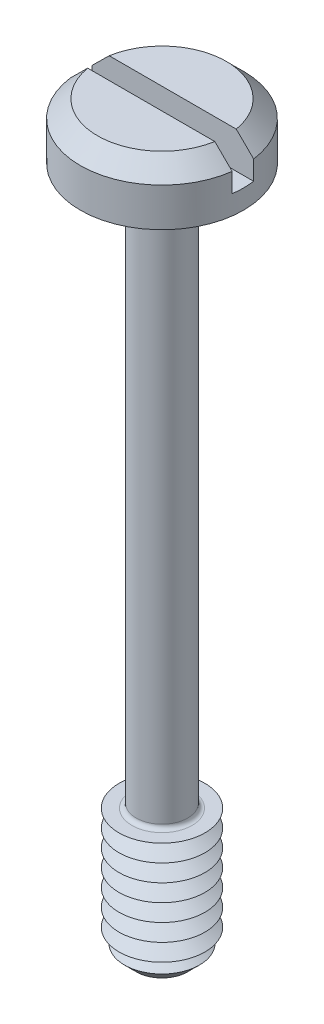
ISO-10303-21;
HEADER;
FILE_DESCRIPTION(('STEP AP214'),'2;1');
FILE_NAME('part.step','',(''),(''),'','','');
FILE_SCHEMA(('AUTOMOTIVE_DESIGN { 1 0 10303 214 1 1 1 1 }'));
ENDSEC;
DATA;
#1=APPLICATION_CONTEXT('core data for automotive mechanical design processes');
#2=APPLICATION_PROTOCOL_DEFINITION('international standard','automotive_design',2000,#1);
#3=PRODUCT_CONTEXT('',#1,'mechanical');
#4=PRODUCT('Part','Part','',(#3));
#5=PRODUCT_RELATED_PRODUCT_CATEGORY('part','',(#4));
#6=PRODUCT_DEFINITION_FORMATION('','',#4);
#7=PRODUCT_DEFINITION_CONTEXT('part definition',#1,'design');
#8=PRODUCT_DEFINITION('design','',#6,#7);
#9=PRODUCT_DEFINITION_SHAPE('','',#8);
#10=(LENGTH_UNIT() NAMED_UNIT(*) SI_UNIT(.MILLI.,.METRE.));
#11=(NAMED_UNIT(*) PLANE_ANGLE_UNIT() SI_UNIT($,.RADIAN.));
#12=(NAMED_UNIT(*) SI_UNIT($,.STERADIAN.) SOLID_ANGLE_UNIT());
#13=UNCERTAINTY_MEASURE_WITH_UNIT(LENGTH_MEASURE(1.E-05),#10,'distance_accuracy_value','');
#14=(GEOMETRIC_REPRESENTATION_CONTEXT(3) GLOBAL_UNCERTAINTY_ASSIGNED_CONTEXT((#13)) GLOBAL_UNIT_ASSIGNED_CONTEXT((#10,
#11,#12)) REPRESENTATION_CONTEXT('',''));
#15=CARTESIAN_POINT('',(0.,0.,0.));
#16=DIRECTION('',(0.,0.,1.));
#17=DIRECTION('',(1.,0.,0.));
#18=AXIS2_PLACEMENT_3D('',#15,#16,#17);
#19=CARTESIAN_POINT('',(0.,1.3,0.));
#20=DIRECTION('',(0.,1.,0.));
#21=DIRECTION('',(0.,0.,1.));
#22=AXIS2_PLACEMENT_3D('',#19,#20,#21);
#23=PLANE('',#22);
#24=DIRECTION('',(-1.,0.,0.));
#25=VECTOR('',#24,1.);
#26=CARTESIAN_POINT('',(1.9,1.3,-0.25));
#27=LINE('',#26,#25);
#28=CARTESIAN_POINT('',(1.4790199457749,1.3,-0.25));
#29=VERTEX_POINT('',#28);
#30=CARTESIAN_POINT('',(-1.4790199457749,1.3,-0.25));
#31=VERTEX_POINT('',#30);
#32=EDGE_CURVE('E110',#29,#31,#27,.T.);
#33=ORIENTED_EDGE('',*,*,#32,.F.);
#34=CARTESIAN_POINT('',(0.,1.3,0.));
#35=DIRECTION('',(0.,1.,0.));
#36=DIRECTION('',(0.,0.,1.));
#37=AXIS2_PLACEMENT_3D('',#34,#35,#36);
#38=CIRCLE('',#37,1.5);
#39=EDGE_CURVE('E113',#29,#31,#38,.T.);
#40=ORIENTED_EDGE('',*,*,#39,.T.);
#41=EDGE_LOOP('',(#33,#40));
#42=FACE_BOUND('',#41,.T.);
#43=ADVANCED_FACE('F39',(#42),#23,.T.);
#44=CARTESIAN_POINT('',(0.,1.3,0.));
#45=DIRECTION('',(0.,-1.,0.));
#46=DIRECTION('',(0.,0.,-1.));
#47=AXIS2_PLACEMENT_3D('',#44,#45,#46);
#48=CONICAL_SURFACE('',#47,1.5,0.785398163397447);
#49=CARTESIAN_POINT('',(4.18533688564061,-1.39279678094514,-0.25));
#50=CARTESIAN_POINT('',(4.04229038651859,-1.25000682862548,-0.25));
#51=CARTESIAN_POINT('',(3.89923277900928,-1.10722799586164,-0.25));
#52=CARTESIAN_POINT('',(3.61307916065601,-0.821704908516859,-0.25));
#53=CARTESIAN_POINT('',(3.46998314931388,-0.67896065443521,-0.25));
#54=CARTESIAN_POINT('',(3.1836962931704,-0.39347893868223,-0.25));
#55=CARTESIAN_POINT('',(3.0405054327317,-0.250741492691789,-0.25));
#56=CARTESIAN_POINT('',(2.75404923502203,0.0346548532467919,-0.25));
#57=CARTESIAN_POINT('',(2.61078389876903,0.177313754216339,-0.25));
#58=CARTESIAN_POINT('',(2.32055190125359,0.466067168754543,-0.25));
#59=CARTESIAN_POINT('',(2.17358212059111,0.612158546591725,-0.25));
#60=CARTESIAN_POINT('',(1.87941274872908,0.904121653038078,-0.25));
#61=CARTESIAN_POINT('',(1.73221314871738,1.04999337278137,-0.25));
#62=CARTESIAN_POINT('',(1.51107316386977,1.26842721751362,-0.25));
#63=CARTESIAN_POINT('',(1.43731034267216,1.34116907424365,-0.25));
#64=CARTESIAN_POINT('',(1.28959621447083,1.48646381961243,-0.25));
#65=CARTESIAN_POINT('',(1.21564490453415,1.55901670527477,-0.25));
#66=CARTESIAN_POINT('',(1.06743357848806,1.7037953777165,-0.25));
#67=CARTESIAN_POINT('',(0.993173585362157,1.77602118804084,-0.25));
#68=CARTESIAN_POINT('',(0.844093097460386,1.91989140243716,-0.25));
#69=CARTESIAN_POINT('',(0.769272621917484,1.99153582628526,-0.25));
#70=CARTESIAN_POINT('',(0.673453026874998,2.0816726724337,-0.25));
#71=CARTESIAN_POINT('',(0.653038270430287,2.10078477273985,-0.25));
#72=CARTESIAN_POINT('',(0.612082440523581,2.13887320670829,-0.25));
#73=CARTESIAN_POINT('',(0.591541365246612,2.15784953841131,-0.25));
#74=CARTESIAN_POINT('',(0.529771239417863,2.21444296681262,-0.25));
#75=CARTESIAN_POINT('',(0.488307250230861,2.25180787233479,-0.25));
#76=CARTESIAN_POINT('',(0.419663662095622,2.31168392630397,-0.25));
#77=CARTESIAN_POINT('',(0.392840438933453,2.33460285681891,-0.25));
#78=CARTESIAN_POINT('',(0.33832923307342,2.37961554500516,-0.25));
#79=CARTESIAN_POINT('',(0.310638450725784,2.40170598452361,-0.25));
#80=CARTESIAN_POINT('',(0.26798327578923,2.43362951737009,-0.25));
#81=CARTESIAN_POINT('',(0.253509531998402,2.44411383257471,-0.25));
#82=CARTESIAN_POINT('',(0.224109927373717,2.46442369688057,-0.25));
#83=CARTESIAN_POINT('',(0.209184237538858,2.47424949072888,-0.25));
#84=CARTESIAN_POINT('',(0.178776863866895,2.49288890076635,-0.25));
#85=CARTESIAN_POINT('',(0.163297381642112,2.50170604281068,-0.25));
#86=CARTESIAN_POINT('',(0.131578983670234,2.51781823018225,-0.25));
#87=CARTESIAN_POINT('',(0.11534152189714,2.52511605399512,-0.25));
#88=CARTESIAN_POINT('',(0.0816993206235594,2.53745946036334,-0.25));
#89=CARTESIAN_POINT('',(0.0642805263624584,2.54246888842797,-0.25));
#90=CARTESIAN_POINT('',(0.028863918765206,2.54892929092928,-0.25));
#91=CARTESIAN_POINT('',(0.0108708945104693,2.55040442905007,-0.25));
#92=CARTESIAN_POINT('',(-0.0250443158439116,2.54939473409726,-0.25));
#93=CARTESIAN_POINT('',(-0.0429661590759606,2.54689872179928,-0.25));
#94=CARTESIAN_POINT('',(-0.0781147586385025,2.53864961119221,-0.25));
#95=CARTESIAN_POINT('',(-0.0953356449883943,2.53287340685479,-0.25));
#96=CARTESIAN_POINT('',(-0.132199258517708,2.51779776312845,-0.25));
#97=CARTESIAN_POINT('',(-0.151639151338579,2.50802516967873,-0.25));
#98=CARTESIAN_POINT('',(-0.189519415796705,2.48667393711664,-0.25));
#99=CARTESIAN_POINT('',(-0.20795716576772,2.47509084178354,-0.25));
#100=CARTESIAN_POINT('',(-0.244227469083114,2.45076455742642,-0.25));
#101=CARTESIAN_POINT('',(-0.262054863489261,2.4380137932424,-0.25));
#102=CARTESIAN_POINT('',(-0.297164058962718,2.41183569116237,-0.25));
#103=CARTESIAN_POINT('',(-0.314446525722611,2.39840923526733,-0.25));
#104=CARTESIAN_POINT('',(-0.37105344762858,2.35323015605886,-0.25));
#105=CARTESIAN_POINT('',(-0.409598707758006,2.32050831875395,-0.25));
#106=CARTESIAN_POINT('',(-0.485753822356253,2.25398879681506,-0.25));
#107=CARTESIAN_POINT('',(-0.5233632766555,2.22019066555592,-0.25));
#108=CARTESIAN_POINT('',(-0.598084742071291,2.15194710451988,-0.25));
#109=CARTESIAN_POINT('',(-0.635196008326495,2.1175008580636,-0.25));
#110=CARTESIAN_POINT('',(-0.709072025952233,2.04825489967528,-0.25));
#111=CARTESIAN_POINT('',(-0.745836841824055,2.0134552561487,-0.25));
#112=CARTESIAN_POINT('',(-0.855349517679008,1.90914588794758,-0.25));
#113=CARTESIAN_POINT('',(-0.927775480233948,1.83929849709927,-0.25));
#114=CARTESIAN_POINT('',(-1.07215273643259,1.69921833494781,-0.25));
#115=CARTESIAN_POINT('',(-1.14410432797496,1.62898586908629,-0.25));
#116=CARTESIAN_POINT('',(-1.33992197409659,1.43719038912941,-0.25));
#117=CARTESIAN_POINT('',(-1.46354933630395,1.3153837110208,-0.25));
#118=CARTESIAN_POINT('',(-1.71048263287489,1.07144356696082,-0.25));
#119=CARTESIAN_POINT('',(-1.83378856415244,0.949310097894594,-0.25));
#120=CARTESIAN_POINT('',(-2.20352581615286,0.582566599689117,-0.25));
#121=CARTESIAN_POINT('',(-2.44969583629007,0.337693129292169,-0.25));
#122=CARTESIAN_POINT('',(-2.94423335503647,-0.154747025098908,-0.25));
#123=CARTESIAN_POINT('',(-3.19259832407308,-0.402316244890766,-0.25));
#124=CARTESIAN_POINT('',(-3.68909403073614,-0.897516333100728,-0.25));
#125=CARTESIAN_POINT('',(-3.93722481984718,-1.14514714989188,-0.25));
#126=CARTESIAN_POINT('',(-4.18533688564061,-1.39279678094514,-0.25));
#127=B_SPLINE_CURVE_WITH_KNOTS('',3,(#49,#50,#51,#52,#53,#54,#55,#56,#57,#58,#59,#60,#61,#62,
#63,#64,#65,#66,#67,#68,#69,#70,#71,#72,#73,#74,#75,#76,#77,#78,#79,#80,#81,#82,#83,#84,#85,#86,
#87,#88,#89,#90,#91,#92,#93,#94,#95,#96,#97,#98,#99,#100,#101,#102,#103,#104,#105,#106,#107,
#108,#109,#110,#111,#112,#113,#114,#115,#116,#117,#118,#119,#120,#121,#122,#123,#124,#125,#126),
.UNSPECIFIED.,.F.,.F.,(4,2,2,2,2,2,2,2,2,2,2,2,2,2,2,2,2,2,2,2,2,2,2,2,2,2,2,2,2,2,2,2,2,2,2,2,
2,2,4),(0.,0.606350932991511,1.2127101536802,1.81925643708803,2.42579463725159,3.04747398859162,
3.66917779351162,3.97996857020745,4.29076421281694,4.60153711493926,4.91229940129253,
4.99619332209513,5.08008845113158,5.24751495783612,5.35335108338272,5.45957361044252,
5.51317784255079,5.56676204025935,5.62015280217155,5.67344504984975,5.72755238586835,
5.78128872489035,5.83517660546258,5.88944887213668,5.95455572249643,6.01982542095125,
6.08555345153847,6.15119780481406,6.30282427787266,6.45451451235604,6.60641073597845,
6.75827809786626,7.06012987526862,7.36176945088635,7.88242595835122,8.40308744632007,
9.44475070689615,10.4967873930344,11.5484571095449),.UNSPECIFIED.);
#128=CARTESIAN_POINT('',(1.88348082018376,0.899999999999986,-0.25));
#129=VERTEX_POINT('',#128);
#130=EDGE_CURVE('E252',#129,#29,#127,.T.);
#131=ORIENTED_EDGE('',*,*,#130,.F.);
#132=CARTESIAN_POINT('',(0.,0.9,0.));
#133=DIRECTION('',(0.,1.,0.));
#134=DIRECTION('',(0.,0.,1.));
#135=AXIS2_PLACEMENT_3D('',#132,#133,#134);
#136=CIRCLE('',#135,1.9);
#137=CARTESIAN_POINT('',(-1.88348082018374,0.9,-0.25));
#138=VERTEX_POINT('',#137);
#139=EDGE_CURVE('E128',#138,#129,#136,.F.);
#140=ORIENTED_EDGE('',*,*,#139,.F.);
#141=EDGE_CURVE('E102',#31,#138,#127,.T.);
#142=ORIENTED_EDGE('',*,*,#141,.F.);
#143=ORIENTED_EDGE('',*,*,#39,.F.);
#144=EDGE_LOOP('',(#131,#140,#142,#143));
#145=FACE_BOUND('',#144,.T.);
#146=ADVANCED_FACE('F214',(#145),#48,.T.);
#147=CARTESIAN_POINT('',(0.,-16.,0.));
#148=DIRECTION('',(0.,1.,0.));
#149=DIRECTION('',(0.,0.,1.));
#150=AXIS2_PLACEMENT_3D('',#147,#148,#149);
#151=CYLINDRICAL_SURFACE('',#150,0.6);
#152=CARTESIAN_POINT('',(0.,-12.9,0.));
#153=DIRECTION('',(0.,-1.,0.));
#154=DIRECTION('',(0.,0.,-1.));
#155=AXIS2_PLACEMENT_3D('',#152,#153,#154);
#156=CIRCLE('',#155,0.6);
#157=CARTESIAN_POINT('',(0.,-12.9,-0.6));
#158=VERTEX_POINT('',#157);
#159=EDGE_CURVE('E123',#158,#158,#156,.F.);
#160=ORIENTED_EDGE('',*,*,#159,.T.);
#161=EDGE_LOOP('',(#160));
#162=FACE_BOUND('',#161,.T.);
#163=CARTESIAN_POINT('',(0.,-0.0999999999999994,0.));
#164=DIRECTION('',(0.,1.,0.));
#165=DIRECTION('',(0.,0.,1.));
#166=AXIS2_PLACEMENT_3D('',#163,#164,#165);
#167=CIRCLE('',#166,0.6);
#168=CARTESIAN_POINT('',(0.,-0.0999999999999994,0.6));
#169=VERTEX_POINT('',#168);
#170=EDGE_CURVE('E351',#169,#169,#167,.F.);
#171=ORIENTED_EDGE('',*,*,#170,.T.);
#172=EDGE_LOOP('',(#171));
#173=FACE_BOUND('',#172,.T.);
#174=ADVANCED_FACE('F210',(#162,#173),#151,.T.);
#175=CARTESIAN_POINT('',(0.,1.3,0.));
#176=DIRECTION('',(0.,-1.,0.));
#177=DIRECTION('',(0.,0.,-1.));
#178=AXIS2_PLACEMENT_3D('',#175,#176,#177);
#179=CYLINDRICAL_SURFACE('',#178,1.9);
#180=ORIENTED_EDGE('',*,*,#139,.T.);
#181=DIRECTION('',(0.,-1.,0.));
#182=VECTOR('',#181,1.);
#183=CARTESIAN_POINT('',(1.88348082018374,1.3,-0.25));
#184=LINE('',#183,#182);
#185=CARTESIAN_POINT('',(1.88348082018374,0.45,-0.25));
#186=VERTEX_POINT('',#185);
#187=EDGE_CURVE('E64',#129,#186,#184,.T.);
#188=ORIENTED_EDGE('',*,*,#187,.T.);
#189=CARTESIAN_POINT('',(0.,0.45,0.));
#190=DIRECTION('',(0.,1.,0.));
#191=DIRECTION('',(0.,0.,1.));
#192=AXIS2_PLACEMENT_3D('',#189,#190,#191);
#193=CIRCLE('',#192,1.9);
#194=CARTESIAN_POINT('',(1.88348082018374,0.45,0.25));
#195=VERTEX_POINT('',#194);
#196=EDGE_CURVE('E11',#195,#186,#193,.T.);
#197=ORIENTED_EDGE('',*,*,#196,.F.);
#198=DIRECTION('',(0.,-1.,0.));
#199=VECTOR('',#198,1.);
#200=CARTESIAN_POINT('',(1.88348082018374,1.3,0.25));
#201=LINE('',#200,#199);
#202=CARTESIAN_POINT('',(1.88348082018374,0.9,0.25));
#203=VERTEX_POINT('',#202);
#204=EDGE_CURVE('E271',#195,#203,#201,.F.);
#205=ORIENTED_EDGE('',*,*,#204,.T.);
#206=CARTESIAN_POINT('',(-1.88348082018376,0.899999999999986,0.25));
#207=VERTEX_POINT('',#206);
#208=EDGE_CURVE('E120',#203,#207,#136,.F.);
#209=ORIENTED_EDGE('',*,*,#208,.T.);
#210=DIRECTION('',(0.,-1.,0.));
#211=VECTOR('',#210,1.);
#212=CARTESIAN_POINT('',(-1.88348082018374,1.3,0.25));
#213=LINE('',#212,#211);
#214=CARTESIAN_POINT('',(-1.88348082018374,0.45,0.25));
#215=VERTEX_POINT('',#214);
#216=EDGE_CURVE('E96',#207,#215,#213,.T.);
#217=ORIENTED_EDGE('',*,*,#216,.T.);
#218=CARTESIAN_POINT('',(-1.88348082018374,0.45,-0.25));
#219=VERTEX_POINT('',#218);
#220=EDGE_CURVE('E44',#219,#215,#193,.T.);
#221=ORIENTED_EDGE('',*,*,#220,.F.);
#222=DIRECTION('',(0.,-1.,0.));
#223=VECTOR('',#222,1.);
#224=CARTESIAN_POINT('',(-1.88348082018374,1.3,-0.25));
#225=LINE('',#224,#223);
#226=EDGE_CURVE('E275',#219,#138,#225,.F.);
#227=ORIENTED_EDGE('',*,*,#226,.T.);
#228=EDGE_LOOP('',(#180,#188,#197,#205,#209,#217,#221,#227));
#229=FACE_BOUND('',#228,.T.);
#230=CARTESIAN_POINT('',(0.,0.,0.));
#231=DIRECTION('',(0.,1.,0.));
#232=DIRECTION('',(0.,0.,1.));
#233=AXIS2_PLACEMENT_3D('',#230,#231,#232);
#234=CIRCLE('',#233,1.9);
#235=CARTESIAN_POINT('',(0.,0.,1.9));
#236=VERTEX_POINT('',#235);
#237=EDGE_CURVE('E336',#236,#236,#234,.T.);
#238=ORIENTED_EDGE('',*,*,#237,.T.);
#239=EDGE_LOOP('',(#238));
#240=FACE_BOUND('',#239,.T.);
#241=ADVANCED_FACE('F213',(#229,#240),#179,.T.);
#242=DIRECTION('',(1.,0.,0.));
#243=VECTOR('',#242,1.);
#244=CARTESIAN_POINT('',(1.9,1.3,0.25));
#245=LINE('',#244,#243);
#246=CARTESIAN_POINT('',(-1.4790199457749,1.3,0.25));
#247=VERTEX_POINT('',#246);
#248=CARTESIAN_POINT('',(1.47901994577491,1.3,0.25));
#249=VERTEX_POINT('',#248);
#250=EDGE_CURVE('E56',#247,#249,#245,.T.);
#251=ORIENTED_EDGE('',*,*,#250,.F.);
#252=EDGE_CURVE('E108',#247,#249,#38,.T.);
#253=ORIENTED_EDGE('',*,*,#252,.T.);
#254=EDGE_LOOP('',(#251,#253));
#255=FACE_BOUND('',#254,.T.);
#256=ADVANCED_FACE('F107',(#255),#23,.T.);
#257=CARTESIAN_POINT('',(0.,0.,0.));
#258=DIRECTION('',(0.,1.,0.));
#259=DIRECTION('',(0.,0.,1.));
#260=AXIS2_PLACEMENT_3D('',#257,#258,#259);
#261=PLANE('',#260);
#262=CARTESIAN_POINT('',(0.,0.,0.));
#263=DIRECTION('',(0.,1.,0.));
#264=DIRECTION('',(0.,0.,1.));
#265=AXIS2_PLACEMENT_3D('',#262,#263,#264);
#266=CIRCLE('',#265,0.7);
#267=CARTESIAN_POINT('',(0.,0.,0.7));
#268=VERTEX_POINT('',#267);
#269=EDGE_CURVE('E114',#268,#268,#266,.T.);
#270=ORIENTED_EDGE('',*,*,#269,.T.);
#271=EDGE_LOOP('',(#270));
#272=FACE_BOUND('',#271,.T.);
#273=ORIENTED_EDGE('',*,*,#237,.F.);
#274=EDGE_LOOP('',(#273));
#275=FACE_BOUND('',#274,.T.);
#276=ADVANCED_FACE('F204',(#272,#275),#261,.F.);
#277=CARTESIAN_POINT('',(0.,-13.,0.));
#278=DIRECTION('',(0.,-1.,0.));
#279=DIRECTION('',(0.,0.,-1.));
#280=AXIS2_PLACEMENT_3D('',#277,#278,#279);
#281=PLANE('',#280);
#282=CARTESIAN_POINT('',(0.,-13.,0.));
#283=DIRECTION('',(0.,-1.,0.));
#284=DIRECTION('',(0.,0.,-1.));
#285=AXIS2_PLACEMENT_3D('',#282,#283,#284);
#286=CIRCLE('',#285,0.7);
#287=CARTESIAN_POINT('',(0.,-13.,-0.7));
#288=VERTEX_POINT('',#287);
#289=EDGE_CURVE('E344',#288,#288,#286,.T.);
#290=ORIENTED_EDGE('',*,*,#289,.T.);
#291=EDGE_LOOP('',(#290));
#292=FACE_BOUND('',#291,.T.);
#293=CARTESIAN_POINT('',(0.,-13.,0.));
#294=DIRECTION('',(0.,1.,0.));
#295=DIRECTION('',(0.,0.,1.));
#296=AXIS2_PLACEMENT_3D('',#293,#294,#295);
#297=CIRCLE('',#296,1.);
#298=CARTESIAN_POINT('',(0.,-13.,1.));
#299=VERTEX_POINT('',#298);
#300=EDGE_CURVE('E333',#299,#299,#297,.T.);
#301=ORIENTED_EDGE('',*,*,#300,.T.);
#302=EDGE_LOOP('',(#301));
#303=FACE_BOUND('',#302,.T.);
#304=ADVANCED_FACE('F200',(#292,#303),#281,.F.);
#305=CARTESIAN_POINT('',(0.,-13.2,0.));
#306=DIRECTION('',(0.,1.,0.));
#307=DIRECTION('',(0.,0.,1.));
#308=AXIS2_PLACEMENT_3D('',#305,#306,#307);
#309=CONICAL_SURFACE('',#308,0.653589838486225,1.0471975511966);
#310=ORIENTED_EDGE('',*,*,#300,.F.);
#311=EDGE_LOOP('',(#310));
#312=FACE_BOUND('',#311,.T.);
#313=CARTESIAN_POINT('',(0.,-13.2,0.));
#314=DIRECTION('',(0.,1.,0.));
#315=DIRECTION('',(0.,0.,1.));
#316=AXIS2_PLACEMENT_3D('',#313,#314,#315);
#317=CIRCLE('',#316,0.653589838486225);
#318=CARTESIAN_POINT('',(0.,-13.2,0.653589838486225));
#319=VERTEX_POINT('',#318);
#320=EDGE_CURVE('E329',#319,#319,#317,.T.);
#321=ORIENTED_EDGE('',*,*,#320,.T.);
#322=EDGE_LOOP('',(#321));
#323=FACE_BOUND('',#322,.T.);
#324=ADVANCED_FACE('F196',(#312,#323),#309,.T.);
#325=CARTESIAN_POINT('',(0.,-13.4,0.));
#326=DIRECTION('',(0.,-1.,0.));
#327=DIRECTION('',(0.,0.,-1.));
#328=AXIS2_PLACEMENT_3D('',#325,#326,#327);
#329=CONICAL_SURFACE('',#328,1.,1.0471975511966);
#330=ORIENTED_EDGE('',*,*,#320,.F.);
#331=EDGE_LOOP('',(#330));
#332=FACE_BOUND('',#331,.T.);
#333=CARTESIAN_POINT('',(0.,-13.4,0.));
#334=DIRECTION('',(0.,1.,0.));
#335=DIRECTION('',(0.,0.,1.));
#336=AXIS2_PLACEMENT_3D('',#333,#334,#335);
#337=CIRCLE('',#336,1.);
#338=CARTESIAN_POINT('',(0.,-13.4,1.));
#339=VERTEX_POINT('',#338);
#340=EDGE_CURVE('E326',#339,#339,#337,.T.);
#341=ORIENTED_EDGE('',*,*,#340,.T.);
#342=EDGE_LOOP('',(#341));
#343=FACE_BOUND('',#342,.T.);
#344=ADVANCED_FACE('F192',(#332,#343),#329,.T.);
#345=CARTESIAN_POINT('',(0.,-13.6,0.));
#346=DIRECTION('',(0.,1.,0.));
#347=DIRECTION('',(0.,0.,1.));
#348=AXIS2_PLACEMENT_3D('',#345,#346,#347);
#349=CONICAL_SURFACE('',#348,0.653589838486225,1.0471975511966);
#350=ORIENTED_EDGE('',*,*,#340,.F.);
#351=EDGE_LOOP('',(#350));
#352=FACE_BOUND('',#351,.T.);
#353=CARTESIAN_POINT('',(0.,-13.6,0.));
#354=DIRECTION('',(0.,1.,0.));
#355=DIRECTION('',(0.,0.,1.));
#356=AXIS2_PLACEMENT_3D('',#353,#354,#355);
#357=CIRCLE('',#356,0.653589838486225);
#358=CARTESIAN_POINT('',(0.,-13.6,0.653589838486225));
#359=VERTEX_POINT('',#358);
#360=EDGE_CURVE('E323',#359,#359,#357,.T.);
#361=ORIENTED_EDGE('',*,*,#360,.T.);
#362=EDGE_LOOP('',(#361));
#363=FACE_BOUND('',#362,.T.);
#364=ADVANCED_FACE('F188',(#352,#363),#349,.T.);
#365=CARTESIAN_POINT('',(0.,-13.8,0.));
#366=DIRECTION('',(0.,-1.,0.));
#367=DIRECTION('',(0.,0.,-1.));
#368=AXIS2_PLACEMENT_3D('',#365,#366,#367);
#369=CONICAL_SURFACE('',#368,1.,1.0471975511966);
#370=ORIENTED_EDGE('',*,*,#360,.F.);
#371=EDGE_LOOP('',(#370));
#372=FACE_BOUND('',#371,.T.);
#373=CARTESIAN_POINT('',(0.,-13.8,0.));
#374=DIRECTION('',(0.,1.,0.));
#375=DIRECTION('',(0.,0.,1.));
#376=AXIS2_PLACEMENT_3D('',#373,#374,#375);
#377=CIRCLE('',#376,1.);
#378=CARTESIAN_POINT('',(0.,-13.8,1.));
#379=VERTEX_POINT('',#378);
#380=EDGE_CURVE('E319',#379,#379,#377,.T.);
#381=ORIENTED_EDGE('',*,*,#380,.T.);
#382=EDGE_LOOP('',(#381));
#383=FACE_BOUND('',#382,.T.);
#384=ADVANCED_FACE('F184',(#372,#383),#369,.T.);
#385=CARTESIAN_POINT('',(0.,-14.,0.));
#386=DIRECTION('',(0.,1.,0.));
#387=DIRECTION('',(0.,0.,1.));
#388=AXIS2_PLACEMENT_3D('',#385,#386,#387);
#389=CONICAL_SURFACE('',#388,0.653589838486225,1.0471975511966);
#390=ORIENTED_EDGE('',*,*,#380,.F.);
#391=EDGE_LOOP('',(#390));
#392=FACE_BOUND('',#391,.T.);
#393=CARTESIAN_POINT('',(0.,-14.,0.));
#394=DIRECTION('',(0.,1.,0.));
#395=DIRECTION('',(0.,0.,1.));
#396=AXIS2_PLACEMENT_3D('',#393,#394,#395);
#397=CIRCLE('',#396,0.653589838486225);
#398=CARTESIAN_POINT('',(0.,-14.,0.653589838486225));
#399=VERTEX_POINT('',#398);
#400=EDGE_CURVE('E315',#399,#399,#397,.T.);
#401=ORIENTED_EDGE('',*,*,#400,.T.);
#402=EDGE_LOOP('',(#401));
#403=FACE_BOUND('',#402,.T.);
#404=ADVANCED_FACE('F180',(#392,#403),#389,.T.);
#405=CARTESIAN_POINT('',(0.,-14.2,0.));
#406=DIRECTION('',(0.,-1.,0.));
#407=DIRECTION('',(0.,0.,-1.));
#408=AXIS2_PLACEMENT_3D('',#405,#406,#407);
#409=CONICAL_SURFACE('',#408,1.,1.0471975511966);
#410=ORIENTED_EDGE('',*,*,#400,.F.);
#411=EDGE_LOOP('',(#410));
#412=FACE_BOUND('',#411,.T.);
#413=CARTESIAN_POINT('',(0.,-14.2,0.));
#414=DIRECTION('',(0.,1.,0.));
#415=DIRECTION('',(0.,0.,1.));
#416=AXIS2_PLACEMENT_3D('',#413,#414,#415);
#417=CIRCLE('',#416,1.);
#418=CARTESIAN_POINT('',(0.,-14.2,1.));
#419=VERTEX_POINT('',#418);
#420=EDGE_CURVE('E311',#419,#419,#417,.T.);
#421=ORIENTED_EDGE('',*,*,#420,.T.);
#422=EDGE_LOOP('',(#421));
#423=FACE_BOUND('',#422,.T.);
#424=ADVANCED_FACE('F176',(#412,#423),#409,.T.);
#425=CARTESIAN_POINT('',(0.,-14.4,0.));
#426=DIRECTION('',(0.,1.,0.));
#427=DIRECTION('',(0.,0.,1.));
#428=AXIS2_PLACEMENT_3D('',#425,#426,#427);
#429=CONICAL_SURFACE('',#428,0.653589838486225,1.0471975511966);
#430=ORIENTED_EDGE('',*,*,#420,.F.);
#431=EDGE_LOOP('',(#430));
#432=FACE_BOUND('',#431,.T.);
#433=CARTESIAN_POINT('',(0.,-14.4,0.));
#434=DIRECTION('',(0.,1.,0.));
#435=DIRECTION('',(0.,0.,1.));
#436=AXIS2_PLACEMENT_3D('',#433,#434,#435);
#437=CIRCLE('',#436,0.653589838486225);
#438=CARTESIAN_POINT('',(0.,-14.4,0.653589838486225));
#439=VERTEX_POINT('',#438);
#440=EDGE_CURVE('E307',#439,#439,#437,.T.);
#441=ORIENTED_EDGE('',*,*,#440,.T.);
#442=EDGE_LOOP('',(#441));
#443=FACE_BOUND('',#442,.T.);
#444=ADVANCED_FACE('F172',(#432,#443),#429,.T.);
#445=CARTESIAN_POINT('',(0.,-14.6,0.));
#446=DIRECTION('',(0.,-1.,0.));
#447=DIRECTION('',(0.,0.,-1.));
#448=AXIS2_PLACEMENT_3D('',#445,#446,#447);
#449=CONICAL_SURFACE('',#448,1.,1.0471975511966);
#450=ORIENTED_EDGE('',*,*,#440,.F.);
#451=EDGE_LOOP('',(#450));
#452=FACE_BOUND('',#451,.T.);
#453=CARTESIAN_POINT('',(0.,-14.6,0.));
#454=DIRECTION('',(0.,1.,0.));
#455=DIRECTION('',(0.,0.,1.));
#456=AXIS2_PLACEMENT_3D('',#453,#454,#455);
#457=CIRCLE('',#456,1.);
#458=CARTESIAN_POINT('',(0.,-14.6,1.));
#459=VERTEX_POINT('',#458);
#460=EDGE_CURVE('E303',#459,#459,#457,.T.);
#461=ORIENTED_EDGE('',*,*,#460,.T.);
#462=EDGE_LOOP('',(#461));
#463=FACE_BOUND('',#462,.T.);
#464=ADVANCED_FACE('F168',(#452,#463),#449,.T.);
#465=CARTESIAN_POINT('',(0.,-14.8,0.));
#466=DIRECTION('',(0.,1.,0.));
#467=DIRECTION('',(0.,0.,1.));
#468=AXIS2_PLACEMENT_3D('',#465,#466,#467);
#469=CONICAL_SURFACE('',#468,0.653589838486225,1.0471975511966);
#470=ORIENTED_EDGE('',*,*,#460,.F.);
#471=EDGE_LOOP('',(#470));
#472=FACE_BOUND('',#471,.T.);
#473=CARTESIAN_POINT('',(0.,-14.8,0.));
#474=DIRECTION('',(0.,1.,0.));
#475=DIRECTION('',(0.,0.,1.));
#476=AXIS2_PLACEMENT_3D('',#473,#474,#475);
#477=CIRCLE('',#476,0.653589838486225);
#478=CARTESIAN_POINT('',(0.,-14.8,0.653589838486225));
#479=VERTEX_POINT('',#478);
#480=EDGE_CURVE('E300',#479,#479,#477,.T.);
#481=ORIENTED_EDGE('',*,*,#480,.T.);
#482=EDGE_LOOP('',(#481));
#483=FACE_BOUND('',#482,.T.);
#484=ADVANCED_FACE('F164',(#472,#483),#469,.T.);
#485=CARTESIAN_POINT('',(0.,-15.,0.));
#486=DIRECTION('',(0.,-1.,0.));
#487=DIRECTION('',(0.,0.,-1.));
#488=AXIS2_PLACEMENT_3D('',#485,#486,#487);
#489=CONICAL_SURFACE('',#488,1.,1.0471975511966);
#490=ORIENTED_EDGE('',*,*,#480,.F.);
#491=EDGE_LOOP('',(#490));
#492=FACE_BOUND('',#491,.T.);
#493=CARTESIAN_POINT('',(0.,-15.,0.));
#494=DIRECTION('',(0.,1.,0.));
#495=DIRECTION('',(0.,0.,1.));
#496=AXIS2_PLACEMENT_3D('',#493,#494,#495);
#497=CIRCLE('',#496,1.);
#498=CARTESIAN_POINT('',(0.,-15.,1.));
#499=VERTEX_POINT('',#498);
#500=EDGE_CURVE('E296',#499,#499,#497,.T.);
#501=ORIENTED_EDGE('',*,*,#500,.T.);
#502=EDGE_LOOP('',(#501));
#503=FACE_BOUND('',#502,.T.);
#504=ADVANCED_FACE('F160',(#492,#503),#489,.T.);
#505=CARTESIAN_POINT('',(0.,-15.2,0.));
#506=DIRECTION('',(0.,1.,0.));
#507=DIRECTION('',(0.,0.,1.));
#508=AXIS2_PLACEMENT_3D('',#505,#506,#507);
#509=CONICAL_SURFACE('',#508,0.653589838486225,1.0471975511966);
#510=ORIENTED_EDGE('',*,*,#500,.F.);
#511=EDGE_LOOP('',(#510));
#512=FACE_BOUND('',#511,.T.);
#513=CARTESIAN_POINT('',(0.,-15.2,0.));
#514=DIRECTION('',(0.,1.,0.));
#515=DIRECTION('',(0.,0.,1.));
#516=AXIS2_PLACEMENT_3D('',#513,#514,#515);
#517=CIRCLE('',#516,0.653589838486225);
#518=CARTESIAN_POINT('',(0.,-15.2,0.653589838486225));
#519=VERTEX_POINT('',#518);
#520=EDGE_CURVE('E293',#519,#519,#517,.T.);
#521=ORIENTED_EDGE('',*,*,#520,.T.);
#522=EDGE_LOOP('',(#521));
#523=FACE_BOUND('',#522,.T.);
#524=ADVANCED_FACE('F156',(#512,#523),#509,.T.);
#525=CARTESIAN_POINT('',(0.,-15.4,0.));
#526=DIRECTION('',(0.,-1.,0.));
#527=DIRECTION('',(0.,0.,-1.));
#528=AXIS2_PLACEMENT_3D('',#525,#526,#527);
#529=CONICAL_SURFACE('',#528,1.,1.0471975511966);
#530=ORIENTED_EDGE('',*,*,#520,.F.);
#531=EDGE_LOOP('',(#530));
#532=FACE_BOUND('',#531,.T.);
#533=CARTESIAN_POINT('',(0.,-15.4,0.));
#534=DIRECTION('',(0.,1.,0.));
#535=DIRECTION('',(0.,0.,1.));
#536=AXIS2_PLACEMENT_3D('',#533,#534,#535);
#537=CIRCLE('',#536,1.);
#538=CARTESIAN_POINT('',(0.,-15.4,1.));
#539=VERTEX_POINT('',#538);
#540=EDGE_CURVE('E288',#539,#539,#537,.T.);
#541=ORIENTED_EDGE('',*,*,#540,.T.);
#542=EDGE_LOOP('',(#541));
#543=FACE_BOUND('',#542,.T.);
#544=ADVANCED_FACE('F152',(#532,#543),#529,.T.);
#545=CARTESIAN_POINT('',(0.,-15.6,0.));
#546=DIRECTION('',(0.,1.,0.));
#547=DIRECTION('',(0.,0.,1.));
#548=AXIS2_PLACEMENT_3D('',#545,#546,#547);
#549=CONICAL_SURFACE('',#548,0.653589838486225,1.0471975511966);
#550=ORIENTED_EDGE('',*,*,#540,.F.);
#551=EDGE_LOOP('',(#550));
#552=FACE_BOUND('',#551,.T.);
#553=CARTESIAN_POINT('',(0.,-15.6,0.));
#554=DIRECTION('',(0.,1.,0.));
#555=DIRECTION('',(0.,0.,1.));
#556=AXIS2_PLACEMENT_3D('',#553,#554,#555);
#557=CIRCLE('',#556,0.653589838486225);
#558=CARTESIAN_POINT('',(0.,-15.6,0.653589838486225));
#559=VERTEX_POINT('',#558);
#560=EDGE_CURVE('E284',#559,#559,#557,.T.);
#561=ORIENTED_EDGE('',*,*,#560,.T.);
#562=EDGE_LOOP('',(#561));
#563=FACE_BOUND('',#562,.T.);
#564=ADVANCED_FACE('F148',(#552,#563),#549,.T.);
#565=CARTESIAN_POINT('',(0.,-15.8,0.));
#566=DIRECTION('',(0.,-1.,0.));
#567=DIRECTION('',(0.,0.,-1.));
#568=AXIS2_PLACEMENT_3D('',#565,#566,#567);
#569=CONICAL_SURFACE('',#568,1.,1.0471975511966);
#570=CARTESIAN_POINT('',(0.,-15.7267949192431,0.));
#571=DIRECTION('',(0.,-1.,0.));
#572=DIRECTION('',(0.,0.,-1.));
#573=AXIS2_PLACEMENT_3D('',#570,#571,#572);
#574=CIRCLE('',#573,0.87320508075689);
#575=CARTESIAN_POINT('',(0.,-15.7267949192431,-0.87320508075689));
#576=VERTEX_POINT('',#575);
#577=EDGE_CURVE('E292',#576,#576,#574,.F.);
#578=ORIENTED_EDGE('',*,*,#577,.T.);
#579=EDGE_LOOP('',(#578));
#580=FACE_BOUND('',#579,.T.);
#581=ORIENTED_EDGE('',*,*,#560,.F.);
#582=EDGE_LOOP('',(#581));
#583=FACE_BOUND('',#582,.T.);
#584=ADVANCED_FACE('F144',(#580,#583),#569,.T.);
#585=CARTESIAN_POINT('',(0.,-16.,0.));
#586=DIRECTION('',(0.,-1.,0.));
#587=DIRECTION('',(0.,0.,-1.));
#588=AXIS2_PLACEMENT_3D('',#585,#586,#587);
#589=PLANE('',#588);
#590=CARTESIAN_POINT('',(0.,-16.,0.));
#591=DIRECTION('',(0.,-1.,0.));
#592=DIRECTION('',(0.,0.,-1.));
#593=AXIS2_PLACEMENT_3D('',#590,#591,#592);
#594=CIRCLE('',#593,0.600000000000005);
#595=CARTESIAN_POINT('',(0.,-16.,-0.600000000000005));
#596=VERTEX_POINT('',#595);
#597=EDGE_CURVE('E340',#596,#596,#594,.T.);
#598=ORIENTED_EDGE('',*,*,#597,.T.);
#599=EDGE_LOOP('',(#598));
#600=FACE_BOUND('',#599,.T.);
#601=ADVANCED_FACE('F147',(#600),#589,.T.);
#602=CARTESIAN_POINT('',(0.,-16.,0.));
#603=DIRECTION('',(0.,1.,0.));
#604=DIRECTION('',(0.,0.,1.));
#605=AXIS2_PLACEMENT_3D('',#602,#603,#604);
#606=CONICAL_SURFACE('',#605,0.600000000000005,0.785398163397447);
#607=ORIENTED_EDGE('',*,*,#577,.F.);
#608=EDGE_LOOP('',(#607));
#609=FACE_BOUND('',#608,.T.);
#610=ORIENTED_EDGE('',*,*,#597,.F.);
#611=EDGE_LOOP('',(#610));
#612=FACE_BOUND('',#611,.T.);
#613=ADVANCED_FACE('F208',(#609,#612),#606,.T.);
#614=CARTESIAN_POINT('',(0.,-12.9,0.));
#615=DIRECTION('',(0.,-1.,0.));
#616=DIRECTION('',(0.,0.,-1.));
#617=AXIS2_PLACEMENT_3D('',#614,#615,#616);
#618=TOROIDAL_SURFACE('',#617,0.7,0.1);
#619=ORIENTED_EDGE('',*,*,#159,.F.);
#620=EDGE_LOOP('',(#619));
#621=FACE_BOUND('',#620,.T.);
#622=ORIENTED_EDGE('',*,*,#289,.F.);
#623=EDGE_LOOP('',(#622));
#624=FACE_BOUND('',#623,.T.);
#625=ADVANCED_FACE('F226',(#621,#624),#618,.F.);
#626=CARTESIAN_POINT('',(0.,-0.0999999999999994,0.));
#627=DIRECTION('',(0.,1.,0.));
#628=DIRECTION('',(0.,0.,1.));
#629=AXIS2_PLACEMENT_3D('',#626,#627,#628);
#630=TOROIDAL_SURFACE('',#629,0.7,0.1);
#631=ORIENTED_EDGE('',*,*,#269,.F.);
#632=EDGE_LOOP('',(#631));
#633=FACE_BOUND('',#632,.T.);
#634=ORIENTED_EDGE('',*,*,#170,.F.);
#635=EDGE_LOOP('',(#634));
#636=FACE_BOUND('',#635,.T.);
#637=ADVANCED_FACE('F229',(#633,#636),#630,.F.);
#638=CARTESIAN_POINT('',(-4.18533688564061,-1.39279678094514,0.25));
#639=CARTESIAN_POINT('',(-4.04229038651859,-1.25000682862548,0.25));
#640=CARTESIAN_POINT('',(-3.89923277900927,-1.10722799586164,0.25));
#641=CARTESIAN_POINT('',(-3.61307916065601,-0.821704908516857,0.25));
#642=CARTESIAN_POINT('',(-3.46998314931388,-0.678960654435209,0.25));
#643=CARTESIAN_POINT('',(-3.1836962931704,-0.393478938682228,0.25));
#644=CARTESIAN_POINT('',(-3.0405054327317,-0.250741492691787,0.25));
#645=CARTESIAN_POINT('',(-2.75404923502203,0.0346548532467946,0.25));
#646=CARTESIAN_POINT('',(-2.61078389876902,0.177313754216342,0.25));
#647=CARTESIAN_POINT('',(-2.32055190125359,0.466067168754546,0.25));
#648=CARTESIAN_POINT('',(-2.17358212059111,0.612158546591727,0.25));
#649=CARTESIAN_POINT('',(-1.87941274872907,0.90412165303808,0.25));
#650=CARTESIAN_POINT('',(-1.73221314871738,1.04999337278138,0.25));
#651=CARTESIAN_POINT('',(-1.51107316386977,1.26842721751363,0.25));
#652=CARTESIAN_POINT('',(-1.43731034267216,1.34116907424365,0.25));
#653=CARTESIAN_POINT('',(-1.28959621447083,1.48646381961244,0.25));
#654=CARTESIAN_POINT('',(-1.21564490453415,1.55901670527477,0.25));
#655=CARTESIAN_POINT('',(-1.06743357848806,1.7037953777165,0.25));
#656=CARTESIAN_POINT('',(-0.993173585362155,1.77602118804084,0.25));
#657=CARTESIAN_POINT('',(-0.844093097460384,1.91989140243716,0.25));
#658=CARTESIAN_POINT('',(-0.769272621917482,1.99153582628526,0.25));
#659=CARTESIAN_POINT('',(-0.673453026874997,2.0816726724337,0.25));
#660=CARTESIAN_POINT('',(-0.653038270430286,2.10078477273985,0.25));
#661=CARTESIAN_POINT('',(-0.61208244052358,2.13887320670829,0.25));
#662=CARTESIAN_POINT('',(-0.591541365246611,2.15784953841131,0.25));
#663=CARTESIAN_POINT('',(-0.529771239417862,2.21444296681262,0.25));
#664=CARTESIAN_POINT('',(-0.488307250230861,2.25180787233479,0.25));
#665=CARTESIAN_POINT('',(-0.419663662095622,2.31168392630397,0.25));
#666=CARTESIAN_POINT('',(-0.392840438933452,2.33460285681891,0.25));
#667=CARTESIAN_POINT('',(-0.338329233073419,2.37961554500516,0.25));
#668=CARTESIAN_POINT('',(-0.310638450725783,2.40170598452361,0.25));
#669=CARTESIAN_POINT('',(-0.26798327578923,2.43362951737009,0.25));
#670=CARTESIAN_POINT('',(-0.253509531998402,2.44411383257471,0.25));
#671=CARTESIAN_POINT('',(-0.224109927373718,2.46442369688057,0.25));
#672=CARTESIAN_POINT('',(-0.209184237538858,2.47424949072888,0.25));
#673=CARTESIAN_POINT('',(-0.178776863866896,2.49288890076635,0.25));
#674=CARTESIAN_POINT('',(-0.163297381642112,2.50170604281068,0.25));
#675=CARTESIAN_POINT('',(-0.131578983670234,2.51781823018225,0.25));
#676=CARTESIAN_POINT('',(-0.115341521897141,2.52511605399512,0.25));
#677=CARTESIAN_POINT('',(-0.0816993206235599,2.53745946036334,0.25));
#678=CARTESIAN_POINT('',(-0.0642805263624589,2.54246888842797,0.25));
#679=CARTESIAN_POINT('',(-0.0288639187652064,2.54892929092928,0.25));
#680=CARTESIAN_POINT('',(-0.0108708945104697,2.55040442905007,0.25));
#681=CARTESIAN_POINT('',(0.0250443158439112,2.54939473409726,0.25));
#682=CARTESIAN_POINT('',(0.0429661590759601,2.54689872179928,0.25));
#683=CARTESIAN_POINT('',(0.0781147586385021,2.53864961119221,0.25));
#684=CARTESIAN_POINT('',(0.0953356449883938,2.53287340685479,0.25));
#685=CARTESIAN_POINT('',(0.132199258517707,2.51779776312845,0.25));
#686=CARTESIAN_POINT('',(0.151639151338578,2.50802516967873,0.25));
#687=CARTESIAN_POINT('',(0.189519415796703,2.48667393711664,0.25));
#688=CARTESIAN_POINT('',(0.207957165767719,2.47509084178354,0.25));
#689=CARTESIAN_POINT('',(0.244227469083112,2.45076455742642,0.25));
#690=CARTESIAN_POINT('',(0.26205486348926,2.4380137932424,0.25));
#691=CARTESIAN_POINT('',(0.297164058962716,2.41183569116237,0.25));
#692=CARTESIAN_POINT('',(0.314446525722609,2.39840923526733,0.25));
#693=CARTESIAN_POINT('',(0.371053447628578,2.35323015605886,0.25));
#694=CARTESIAN_POINT('',(0.409598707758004,2.32050831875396,0.25));
#695=CARTESIAN_POINT('',(0.48575382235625,2.25398879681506,0.25));
#696=CARTESIAN_POINT('',(0.523363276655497,2.22019066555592,0.25));
#697=CARTESIAN_POINT('',(0.598084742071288,2.15194710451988,0.25));
#698=CARTESIAN_POINT('',(0.635196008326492,2.1175008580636,0.25));
#699=CARTESIAN_POINT('',(0.709072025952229,2.04825489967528,0.25));
#700=CARTESIAN_POINT('',(0.74583684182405,2.01345525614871,0.25));
#701=CARTESIAN_POINT('',(0.855349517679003,1.90914588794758,0.25));
#702=CARTESIAN_POINT('',(0.927775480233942,1.83929849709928,0.25));
#703=CARTESIAN_POINT('',(1.07215273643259,1.69921833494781,0.25));
#704=CARTESIAN_POINT('',(1.14410432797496,1.6289858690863,0.25));
#705=CARTESIAN_POINT('',(1.33992197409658,1.43719038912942,0.25));
#706=CARTESIAN_POINT('',(1.46354933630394,1.31538371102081,0.25));
#707=CARTESIAN_POINT('',(1.71048263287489,1.07144356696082,0.25));
#708=CARTESIAN_POINT('',(1.83378856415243,0.949310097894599,0.25));
#709=CARTESIAN_POINT('',(2.20352581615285,0.582566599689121,0.25));
#710=CARTESIAN_POINT('',(2.44969583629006,0.337693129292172,0.25));
#711=CARTESIAN_POINT('',(2.94423335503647,-0.154747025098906,0.25));
#712=CARTESIAN_POINT('',(3.19259832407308,-0.402316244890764,0.25));
#713=CARTESIAN_POINT('',(3.68909403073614,-0.897516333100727,0.25));
#714=CARTESIAN_POINT('',(3.93722481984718,-1.14514714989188,0.25));
#715=CARTESIAN_POINT('',(4.18533688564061,-1.39279678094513,0.25));
#716=B_SPLINE_CURVE_WITH_KNOTS('',3,(#638,#639,#640,#641,#642,#643,#644,#645,#646,#647,#648,
#649,#650,#651,#652,#653,#654,#655,#656,#657,#658,#659,#660,#661,#662,#663,#664,#665,#666,#667,
#668,#669,#670,#671,#672,#673,#674,#675,#676,#677,#678,#679,#680,#681,#682,#683,#684,#685,#686,
#687,#688,#689,#690,#691,#692,#693,#694,#695,#696,#697,#698,#699,#700,#701,#702,#703,#704,#705,
#706,#707,#708,#709,#710,#711,#712,#713,#714,#715),.UNSPECIFIED.,.F.,.F.,(4,2,2,2,2,2,2,2,2,2,2,
2,2,2,2,2,2,2,2,2,2,2,2,2,2,2,2,2,2,2,2,2,2,2,2,2,2,2,4),(0.,0.606350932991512,1.2127101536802,
1.81925643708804,2.42579463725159,3.04747398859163,3.66917779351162,3.97996857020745,
4.29076421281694,4.60153711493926,4.91229940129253,4.99619332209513,5.08008845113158,
5.24751495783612,5.35335108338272,5.45957361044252,5.51317784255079,5.56676204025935,
5.62015280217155,5.67344504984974,5.72755238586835,5.78128872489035,5.83517660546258,
5.88944887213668,5.95455572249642,6.01982542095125,6.08555345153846,6.15119780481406,
6.30282427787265,6.45451451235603,6.60641073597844,6.75827809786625,7.06012987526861,
7.36176945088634,7.88242595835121,8.40308744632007,9.44475070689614,10.4967873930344,
11.5484571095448),.UNSPECIFIED.);
#717=EDGE_CURVE('E92',#207,#247,#716,.T.);
#718=ORIENTED_EDGE('',*,*,#717,.F.);
#719=ORIENTED_EDGE('',*,*,#208,.F.);
#720=EDGE_CURVE('E103',#249,#203,#716,.T.);
#721=ORIENTED_EDGE('',*,*,#720,.F.);
#722=ORIENTED_EDGE('',*,*,#252,.F.);
#723=EDGE_LOOP('',(#718,#719,#721,#722));
#724=FACE_BOUND('',#723,.T.);
#725=ADVANCED_FACE('F41',(#724),#48,.T.);
#726=CARTESIAN_POINT('',(0.,0.45,0.));
#727=DIRECTION('',(0.,1.,0.));
#728=DIRECTION('',(0.,0.,1.));
#729=AXIS2_PLACEMENT_3D('',#726,#727,#728);
#730=PLANE('',#729);
#731=DIRECTION('',(1.,0.,0.));
#732=VECTOR('',#731,1.);
#733=CARTESIAN_POINT('',(1.9,0.45,0.25));
#734=LINE('',#733,#732);
#735=EDGE_CURVE('E249',#215,#195,#734,.T.);
#736=ORIENTED_EDGE('',*,*,#735,.T.);
#737=ORIENTED_EDGE('',*,*,#196,.T.);
#738=DIRECTION('',(-1.,0.,0.));
#739=VECTOR('',#738,1.);
#740=CARTESIAN_POINT('',(1.9,0.45,-0.25));
#741=LINE('',#740,#739);
#742=EDGE_CURVE('E268',#186,#219,#741,.T.);
#743=ORIENTED_EDGE('',*,*,#742,.T.);
#744=ORIENTED_EDGE('',*,*,#220,.T.);
#745=EDGE_LOOP('',(#736,#737,#743,#744));
#746=FACE_BOUND('',#745,.T.);
#747=ADVANCED_FACE('F236',(#746),#730,.T.);
#748=CARTESIAN_POINT('',(1.9,0.45,-0.25));
#749=DIRECTION('',(0.,0.,-1.));
#750=DIRECTION('',(-1.,0.,0.));
#751=AXIS2_PLACEMENT_3D('',#748,#749,#750);
#752=PLANE('',#751);
#753=ORIENTED_EDGE('',*,*,#130,.T.);
#754=ORIENTED_EDGE('',*,*,#32,.T.);
#755=ORIENTED_EDGE('',*,*,#141,.T.);
#756=ORIENTED_EDGE('',*,*,#226,.F.);
#757=ORIENTED_EDGE('',*,*,#742,.F.);
#758=ORIENTED_EDGE('',*,*,#187,.F.);
#759=EDGE_LOOP('',(#753,#754,#755,#756,#757,#758));
#760=FACE_BOUND('',#759,.T.);
#761=ADVANCED_FACE('F141',(#760),#752,.F.);
#762=CARTESIAN_POINT('',(1.9,0.45,0.25));
#763=DIRECTION('',(0.,0.,1.));
#764=DIRECTION('',(1.,0.,0.));
#765=AXIS2_PLACEMENT_3D('',#762,#763,#764);
#766=PLANE('',#765);
#767=ORIENTED_EDGE('',*,*,#717,.T.);
#768=ORIENTED_EDGE('',*,*,#250,.T.);
#769=ORIENTED_EDGE('',*,*,#720,.T.);
#770=ORIENTED_EDGE('',*,*,#204,.F.);
#771=ORIENTED_EDGE('',*,*,#735,.F.);
#772=ORIENTED_EDGE('',*,*,#216,.F.);
#773=EDGE_LOOP('',(#767,#768,#769,#770,#771,#772));
#774=FACE_BOUND('',#773,.T.);
#775=ADVANCED_FACE('F93',(#774),#766,.F.);
#776=CLOSED_SHELL('',(#43,#146,#174,#241,#256,#276,#304,#324,#344,#364,#384,#404,#424,#444,#464,
#484,#504,#524,#544,#564,#584,#601,#613,#625,#637,#725,#747,#761,#775));
#777=MANIFOLD_SOLID_BREP('B2',#776);
#778=ADVANCED_BREP_SHAPE_REPRESENTATION('',(#18,#777),#14);
#779=SHAPE_DEFINITION_REPRESENTATION(#9,#778);
ENDSEC;
END-ISO-10303-21;
